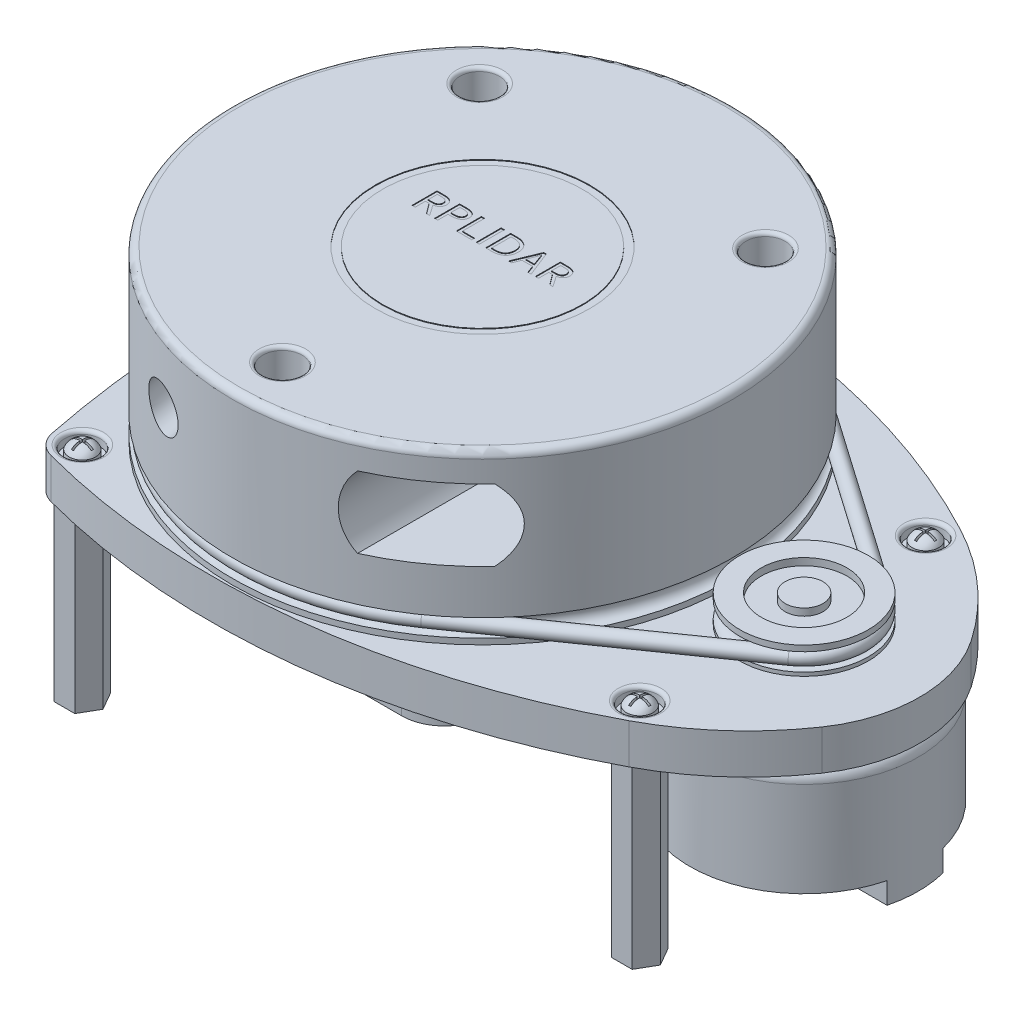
from build123d import *
from build123d.topology import SkipClean

# Parameters (mm, degrees)
SKETCH1_R                   = 35
PUCK_DEPTH                  = 23.5
FILLET1_R                   = 1
CUT_SENSOR_TUNNEL_DEPTH     = 55.792791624
BOSS_BOARD_START            = -0.5
BOSS_BOARD_DEPTH            = 5.6
HEX_STANDOFFS_DEPTH         = 25
SKETCH23_R                  = 2.5
SCREW_SEATS_DEPTH           = 1.5
FILLET_SCREW_SEATS_R        = 0.5
CUT_EXTRUDE5_START          = -0.5
CUT_EXTRUDE5_DEPTH          = 2
SKETCH6_R                   = 16
MOTOR_BODY_DEPTH            = 15
SKETCH9_R                   = 30
MOULD_BOTTOM_DISC_DEPTH     = 3.3
SKETCH10_W                  = 46
SKETCH10_H                  = 57
BOSS_CIRCUIT_DEPTH          = 1.1
FILLET_CIRCUIT_BOARD_R      = 6
SWEEP_BAND_PROFILE_R        = 1
FILLET3_R                   = 1.75
SKETCH18_R                  = 2.75
TOP_PUCK_HOLES_DEPTH        = 8
FILLET_PUCK_HOLES_R         = 0.5
SKETCH19_R                  = 15
SKETCH19_R_2                = 13.98
TOP_RING_AESTHETIC_DEPTH    = 0.1
SKETCH28_W                  = 0.443661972
SKETCH28_H                  = 3.5
RPLIDAR_TEXT_DEPTH          = 0.1
MOTOR_PLASTIC_FEATURE_DEPTH = 3
SKETCH31_R                  = 3.5
CUT_OPTICS_DEPTH            = 78.034465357
CUT_OPTICS_TAPER            = 1
SKETCH37_R                  = 1.25
DRILL_STANDOFFS_DEPTH       = 10


with BuildPart() as part:
    # Sketch1 → puck (new body)
    with BuildSketch(Plane(origin=(0, 0, 0), x_dir=(1, 0, 0), z_dir=(0, 1, 0))):
        with Locations(Location((0, 0, 0), (0, 0, 270))):
            Circle(SKETCH1_R)
    extrude(amount=PUCK_DEPTH)

    # Fillet1
    fillet1_edges = [part.edges().sort_by_distance(p)[0] for p in [
        (0, 23.5, -35),
    ]]
    fillet(fillet1_edges, radius=FILLET1_R)

    # Sketch2 → groove (revolve, cut)
    with BuildSketch(Plane.XY, mode=Mode.PRIVATE) as groove_sk:
        with BuildLine():
            Line((-35, 3.3), (-35, 0.8))
            ThreePointArc((-35, 0.8), (-33.75, 2.05), (-35, 3.3))
        make_face()
    revolve(groove_sk.sketch.rotate(Axis((0, 0, 0), (0, 1, 0)), 270), axis=Axis((0, 0, 0), (0, 1, 0)), mode=Mode.SUBTRACT)

    # Sketch3 → cut_sensor_tunnel (cut, through all)
    with BuildSketch(Plane.XY):
        with BuildLine():
            Line((14.409830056, 19.5), (25.590169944, 19.5))
            ThreePointArc((25.590169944, 19.5), (27.5, 14.5), (25.590169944, 9.5))
            Line((25.590169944, 9.5), (14.409830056, 9.5))
            ThreePointArc((14.409830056, 9.5), (12.5, 14.5), (14.409830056, 19.5))
        make_face()
    extrude(amount=CUT_SENSOR_TUNNEL_DEPTH, mode=Mode.SUBTRACT)



with BuildPart() as body_2:
    # Sketch4 → boss_board (new body)
    with BuildSketch(Plane(origin=(0, 0, 0), x_dir=(1, 0, 0), z_dir=(0, 1, 0)).offset(BOSS_BOARD_START)):
        with BuildLine():
            ThreePointArc((-28.9265577, 31.478719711), (8.165815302, 34.200883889), (43.687550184, 23.179964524))
            ThreePointArc((43.687550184, 23.179964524), (51.581142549, 17.68138932), (57.933651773, 10.457210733))
            ThreePointArc((57.933651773, 10.457210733), (61.172696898, 0), (57.933651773, -10.457210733))
            ThreePointArc((57.933651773, -10.457210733), (51.581142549, -17.68138932), (43.687550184, -23.179964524))
            ThreePointArc((43.687550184, -23.179964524), (8.165815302, -34.200883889), (-28.9265577, -31.478719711))
            ThreePointArc((-28.9265577, -31.478719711), (-30.621991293, -30.466812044), (-31.528712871, -28.712871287))
            ThreePointArc((-31.528712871, -28.712871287), (-34.4, 0), (-31.528712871, 28.712871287))
            ThreePointArc((-31.528712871, 28.712871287), (-30.621991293, 30.466812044), (-28.9265577, 31.478719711))
        make_face()
    extrude(amount=-BOSS_BOARD_DEPTH)

    # Sketch5 → hex_standoffs (add)
    with BuildSketch(Plane.XZ.offset(6.1)):
        Polygon((-26.556624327, 30.5), (-29.443375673, 30.5), (-30.886751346, 28), (-29.443375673, 25.5), (-26.556624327, 25.5), (-25.113248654, 28), align=None)
        Polygon((-26.556624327, -25.5), (-29.443375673, -25.5), (-30.886751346, -28), (-29.443375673, -30.5), (-26.556624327, -30.5), (-25.113248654, -28), align=None)
        Polygon((43.443375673, 22.5), (40.556624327, 22.5), (39.113248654, 20), (40.556624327, 17.5), (43.443375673, 17.5), (44.886751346, 20), align=None)
        Polygon((43.443375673, -17.5), (40.556624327, -17.5), (39.113248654, -20), (40.556624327, -22.5), (43.443375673, -22.5), (44.886751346, -20), align=None)
    extrude(amount=HEX_STANDOFFS_DEPTH)

    # Sketch23 → screw_seats (cut)
    with BuildSketch(Plane(origin=(0, -0.5, 0), x_dir=(1, 0, 0), z_dir=(0, 1, 0))):
        with Locations(Location((-28, 28, 0), (0, 0, 270))):
            Circle(SKETCH23_R)
        with Locations(Location((42, 20, 0), (0, 0, 270))):
            Circle(SKETCH23_R)
        with Locations(Location((42, -20, 0), (0, 0, 270))):
            Circle(SKETCH23_R)
        with Locations(Location((-28, -28, 0), (0, 0, 270))):
            Circle(SKETCH23_R)
    extrude(amount=-SCREW_SEATS_DEPTH, mode=Mode.SUBTRACT)

    # fillet_screw_seats
    fillet_screw_seats_edges = [body_2.edges().sort_by_distance(p)[0] for p in [
        (42, -0.5, 17.5),
        (-28, -0.5, 25.5),
        (-28, -0.5, -30.5),
        (42, -0.5, -22.5),
    ]]
    fillet(fillet_screw_seats_edges, radius=FILLET_SCREW_SEATS_R)

    # Sketch24 → revolve_screw_head (revolve)
    with BuildSketch(Plane.YZ.offset(-28), mode=Mode.PRIVATE) as revolve_screw_head_sk:
        with BuildLine():
            Line((-2, -28), (-2, -26.15))
            Line((-2, -26.15), (-1.041127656, -26.15))
            ThreePointArc((-1.041127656, -26.15), (-0.28319623, -26.795543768), (0, -27.75))
            Line((0, -27.75), (-1, -27.75))
            Line((-1, -27.75), (-1, -28))
            Line((-1, -28), (-2, -28))
        make_face()
    revolve_screw_head = revolve(revolve_screw_head_sk.sketch.rotate(Axis((-28, -2, -28), (0, 1, 0)), 180), axis=Axis((-28, -2, -28), (0, 1, 0)))

    # Sketch25 → Cut-Extrude5 (cut)
    with BuildSketch(Plane(origin=(0, -0.5, 0), x_dir=(1, 0, 0), z_dir=(0, 1, 0)).offset(CUT_EXTRUDE5_START)):
        Polygon((-27.85, 28.15), (-26.6, 28.15), (-26.6, 27.85), (-27.85, 27.85), (-27.85, 26.6), (-28.15, 26.6), (-28.15, 27.85), (-29.4, 27.85), (-29.4, 28.15), (-28.15, 28.15), (-28.15, 29.4), (-27.85, 29.4), align=None)
    cut_extrude5 = extrude(amount=CUT_EXTRUDE5_DEPTH, mode=Mode.SUBTRACT)

    # Sketch-Pattern1: revolve_screw_head, Cut-Extrude5 at 3 more places
    with Locations((70, 0, 8), (70, 0, 48), (0, 0, 56)):
        add(revolve_screw_head)
        add(cut_extrude5, mode=Mode.SUBTRACT)

    # Sketch9 → mould_bottom_disc (add)
    with BuildSketch(Plane.XZ.offset(6.1)):
        with Locations(Location((0, 0, 0), (0, 0, 90))):
            Circle(SKETCH9_R)
    extrude(amount=MOULD_BOTTOM_DISC_DEPTH)

    # Sketch10 → boss_circuit (add)
    with BuildSketch(Plane.XZ.offset(9.4)):
        with Locations((0.172696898, 0)):
            Rectangle(SKETCH10_W, SKETCH10_H)
    extrude(amount=BOSS_CIRCUIT_DEPTH)

    # fillet_circuit_board
    fillet_circuit_board_edges = [body_2.edges().sort_by_distance(p)[0] for p in [
        (-22.827303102, -9.95, 28.5),
        (-22.827303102, -9.95, -28.5),
        (23.172696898, -9.95, -28.5),
        (23.172696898, -9.95, 28.5),
    ]]
    fillet(fillet_circuit_board_edges, radius=FILLET_CIRCUIT_BOARD_R)


with BuildPart() as body_3:
    # Sketch6 → motor_body (new body)
    with BuildSketch(Plane.XZ.offset(6.1)):
        with Locations(Location((45, 0, 0), (0, 0, 270))):
            Circle(SKETCH6_R)
    extrude(amount=MOTOR_BODY_DEPTH)

    # Fillet3
    fillet3_edges = [body_3.edges().sort_by_distance(p)[0] for p in [
        (45, -6.1, 16),
    ]]
    fillet(fillet3_edges, radius=FILLET3_R)


    with SkipClean():  # the faces are left unmerged after this step: merging them gives an invalid solid
        add(body_2.part)  # motor_plastic_feature merges body 2
        # Sketch30 → motor_plastic_feature (add)
        with BuildSketch(Plane.XZ.offset(21.1)):
            with BuildLine():
                Line((29.482590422, 3.9), (60.517409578, 3.9))
                ThreePointArc((60.517409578, 3.9), (61, 0), (60.517409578, -3.9))
                Line((60.517409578, -3.9), (29.482590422, -3.9))
                ThreePointArc((29.482590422, -3.9), (29, 0), (29.482590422, 3.9))
            make_face()
        extrude(amount=MOTOR_PLASTIC_FEATURE_DEPTH)

    # Sketch37 → drill_standoffs (cut)
    with SkipClean():  # the faces are left unmerged after this step: merging them gives an invalid solid
        with BuildSketch(Plane.XZ.offset(31.1)):
            with Locations(Location((-28, 28, 0), (0, 0, 270))):
                Circle(SKETCH37_R)
            with Locations(Location((42, 20, 0), (0, 0, 270))):
                Circle(SKETCH37_R)
            with Locations(Location((-28, -28, 0), (0, 0, 270))):
                Circle(SKETCH37_R)
            with Locations(Location((42, -20, 0), (0, 0, 270))):
                Circle(SKETCH37_R)
        extrude(amount=-DRILL_STANDOFFS_DEPTH, mode=Mode.SUBTRACT)


with BuildPart() as body_4:
    # Sketch8 → motor_pulley (revolve)
    with BuildSketch(Plane.XY, mode=Mode.PRIVATE) as motor_pulley_sk:
        with BuildLine():
            Line((45, 4.1), (47.65, 4.1))
            Line((47.65, 4.1), (47.65, 3.1))
            Line((47.65, 3.1), (51, 3.1))
            Line((51, 3.1), (51, 4.1))
            Line((51, 4.1), (54, 4.1))
            Line((54, 4.1), (54, 3.283896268))
            ThreePointArc((54, 3.283896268), (52.55, 2.05), (54, 0.816103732))
            Line((54, 0.816103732), (54, 0.3))
            Line((54, 0.3), (47, 0.3))
            Line((47, 0.3), (47, 0))
            Line((47, 0), (45, 0))
            Line((45, 0), (45, 4.1))
        make_face()
    revolve(motor_pulley_sk.sketch.rotate(Axis((45, 0, 0), (0, 1, 0)), 90), axis=Axis((45, 0, 0), (0, 1, 0)))


with BuildPart() as part_1:
    add(part.part)

    add(body_4.part)  # sweep_band merges body 4
    # sweep_band: sweep along a path in Sketch12
    with BuildLine(Plane(origin=(0, 2.05, 0), x_dir=(1, 0, 0), z_dir=(0, 1, 0))) as sweep_band_path:
        Line((19.3125, 27.678328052), (49.577777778, 6.560788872))
        ThreePointArc((49.577777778, 6.560788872), (53, 0), (49.577777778, -6.560788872))
        Line((49.577777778, -6.560788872), (19.3125, -27.678328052))
        ThreePointArc((19.3125, -27.678328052), (-33.75, 0), (19.3125, 27.678328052))
    # sweep_band profile (on start of the path) → sweep_band (sweep)
    with BuildSketch(Plane(origin=(19.3125, 2.05, -27.678328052), x_dir=(-0.5722222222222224, 0, 0.8200986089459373), z_dir=(0.8200986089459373, 0, 0.5722222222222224))):
        Circle(SWEEP_BAND_PROFILE_R)
    sweep(path=sweep_band_path.line)

    # Sketch18 → top_puck_holes (cut)
    with BuildSketch(Plane(origin=(0, 23.5, 0), x_dir=(1, 0, 0), z_dir=(0, 1, 0))):
        with Locations(Location((-20, 19.595917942, 0), (0, 0, 270))):
            Circle(SKETCH18_R)
        with Locations(Location((20, 19.595917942, 0), (0, 0, 270))):
            Circle(SKETCH18_R)
        with Locations(Location((0, -28, 0), (0, 0, 270))):
            Circle(SKETCH18_R)
    extrude(amount=-TOP_PUCK_HOLES_DEPTH, mode=Mode.SUBTRACT)

    # fillet_puck_holes
    fillet_puck_holes_edges = [part_1.edges().sort_by_distance(p)[0] for p in [
        (-20, 23.5, -22.345917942),
        (20, 23.5, -22.345917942),
        (0, 23.5, 25.25),
    ]]
    fillet(fillet_puck_holes_edges, radius=FILLET_PUCK_HOLES_R)

    # Sketch19 → top_ring_aesthetic (cut)
    with BuildSketch(Plane(origin=(0, 23.5, 0), x_dir=(1, 0, 0), z_dir=(0, 1, 0))):
        with Locations(Location((0, 0, 0), (0, 0, 270))):
            Circle(SKETCH19_R)
        with Locations(Location((0, 0, 0), (0, 0, 270))):
            Circle(SKETCH19_R_2, mode=Mode.SUBTRACT)
    extrude(amount=-TOP_RING_AESTHETIC_DEPTH, mode=Mode.SUBTRACT)

    # Sketch28 → RPLIDAR_text (cut)
    # profile 1 of 7: a face of its own
    with BuildSketch(Plane(origin=(0, 23.5, 0), x_dir=(1, 0, 0), z_dir=(0, 1, 0))):
        with BuildLine():
            Line((-9.518699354, 1.527961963), (-9.518699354, 0.098384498))
            Line((-9.518699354, 0.098384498), (-9.962361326, 0.098384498))
            Line((-9.962361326, 0.098384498), (-9.962361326, 3.598384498))
            Line((-9.962361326, 3.598384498), (-9.047308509, 3.598384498))
            add(Edge.make_bspline(
                [(-9.047308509, 3.598384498), (-9.010074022, 3.598406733), (-8.938406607, 3.59844953), (-8.835454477, 3.594052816), (-8.741143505, 3.589187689), (-8.629287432, 3.578782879), (-8.500608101, 3.562788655), (-8.402690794, 3.538449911), (-8.355627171, 3.526751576)],
                knots=[0, 0, 0, 0, 0.960912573, 1.849525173, 2.659327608, 3.397884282, 4.749301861, 6, 6, 6, 6], degree=3))
            add(Edge.make_bspline(
                [(-8.355627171, 3.526751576), (-8.32571201, 3.518179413), (-8.267044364, 3.501368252), (-8.182896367, 3.46957633), (-8.103929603, 3.433197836), (-8.030296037, 3.392915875), (-7.962477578, 3.347539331), (-7.899900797, 3.298359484), (-7.842624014, 3.244247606), (-7.791107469, 3.185503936), (-7.744719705, 3.123478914), (-7.705062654, 3.05699123), (-7.671385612, 2.987122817), (-7.643138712, 2.913593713), (-7.622839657, 2.835966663), (-7.607231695, 2.754961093), (-7.597863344, 2.669943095), (-7.596737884, 2.61197871), (-7.596164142, 2.582429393)],
                knots=[0, 0, 0, 0, 1.134140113, 2.224201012, 3.275431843, 4.3018668, 5.280587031, 6.24687456, 7.200337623, 8.148687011, 9.092220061, 10.020068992, 10.966198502, 11.917131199, 12.886677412, 13.887177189, 14.922916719, 16, 16, 16, 16], degree=3))
            add(Edge.make_bspline(
                [(-7.596164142, 2.582429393), (-7.596708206, 2.547714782), (-7.597772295, 2.479819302), (-7.611806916, 2.380968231), (-7.631595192, 2.287193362), (-7.66253987, 2.199922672), (-7.699103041, 2.117905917), (-7.743742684, 2.041835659), (-7.794233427, 1.970683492), (-7.852662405, 1.905951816), (-7.916519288, 1.846214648), (-7.98752068, 1.793148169), (-8.063581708, 1.744207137), (-8.146449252, 1.702193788), (-8.234058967, 1.665367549), (-8.326527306, 1.633842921), (-8.423283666, 1.606327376), (-8.490301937, 1.593685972), (-8.52431115, 1.587270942)],
                knots=[0, 0, 0, 0, 1.112196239, 2.175254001, 3.195927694, 4.180088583, 5.138074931, 6.0714415, 7.003609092, 7.93070943, 8.862804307, 9.803008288, 10.769096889, 11.759573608, 12.777920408, 13.814147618, 14.890763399, 16, 16, 16, 16], degree=3))
            Line((-8.52431115, 1.587270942), (-8.52431115, 1.577257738))
            Line((-8.52431115, 1.577257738), (-7.497572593, 0.098384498))
            Line((-7.497572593, 0.098384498), (-7.941234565, 0.098384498))
            Line((-7.941234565, 0.098384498), (-9.008796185, 1.527961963))
            Line((-9.008796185, 1.527961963), (-9.518699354, 1.527961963))
        make_face()
        with BuildLine():
            Line((-9.518699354, 3.204018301), (-9.518699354, 1.92232816))
            Line((-9.518699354, 1.92232816), (-9.108157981, 1.92232816))
            add(Edge.make_bspline(
                [(-9.108157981, 1.92232816), (-9.077604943, 1.922498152), (-9.018543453, 1.92282676), (-8.933504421, 1.924700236), (-8.855482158, 1.929845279), (-8.762988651, 1.936185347), (-8.657718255, 1.950503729), (-8.57830983, 1.972114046), (-8.540486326, 1.982407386)],
                knots=[0, 0, 0, 0, 0.960008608, 1.855774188, 2.671979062, 3.416289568, 4.769337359, 6, 6, 6, 6], degree=3))
            add(Edge.make_bspline(
                [(-8.540486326, 1.982407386), (-8.505942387, 1.994557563), (-8.439057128, 2.01808319), (-8.34806215, 2.067850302), (-8.269714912, 2.127792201), (-8.203968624, 2.197998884), (-8.150750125, 2.279302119), (-8.115648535, 2.373286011), (-8.092041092, 2.477539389), (-8.090124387, 2.550960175), (-8.089121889, 2.589361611)],
                knots=[0, 0, 0, 0, 1.071897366, 2.075447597, 3.025191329, 3.951603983, 4.882559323, 5.852363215, 6.876716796, 8, 8, 8, 8], degree=3))
            add(Edge.make_bspline(
                [(-8.089121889, 2.589361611), (-8.090561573, 2.625176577), (-8.093324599, 2.693912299), (-8.115315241, 2.791166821), (-8.149790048, 2.877951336), (-8.199465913, 2.952805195), (-8.260469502, 3.017205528), (-8.331379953, 3.07260791), (-8.413259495, 3.117993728), (-8.473353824, 3.138682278), (-8.504284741, 3.149330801)],
                knots=[0, 0, 0, 0, 1.140384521, 2.188614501, 3.161159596, 4.10078681, 5.032829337, 5.977325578, 6.958917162, 8, 8, 8, 8], degree=3))
            add(Edge.make_bspline(
                [(-8.504284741, 3.149330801), (-8.53777504, 3.158218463), (-8.609899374, 3.177358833), (-8.706556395, 3.190130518), (-8.794367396, 3.196598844), (-8.870856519, 3.201671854), (-8.956153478, 3.203533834), (-9.015985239, 3.203851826), (-9.047308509, 3.204018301)],
                knots=[0, 0, 0, 0, 1.138118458, 2.451039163, 3.196085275, 4.033155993, 4.970312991, 6, 6, 6, 6], degree=3))
            Line((-9.047308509, 3.204018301), (-9.518699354, 3.204018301))
        make_face(mode=Mode.SUBTRACT)
    # profile 2 of 7: a face of its own
    with BuildSketch(Plane(origin=(0, 23.5, 0), x_dir=(1, 0, 0), z_dir=(0, 1, 0))):
        with BuildLine():
            Line((-6.363769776, 0.098384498), (-6.807431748, 0.098384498))
            Line((-6.807431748, 0.098384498), (-6.807431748, 3.598384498))
            Line((-6.807431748, 3.598384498), (-5.829988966, 3.598384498))
            add(Edge.make_bspline(
                [(-5.829988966, 3.598384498), (-5.759832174, 3.597462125), (-5.624599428, 3.595684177), (-5.430047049, 3.574869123), (-5.250224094, 3.543768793), (-5.138517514, 3.508439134), (-5.084390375, 3.491320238)],
                knots=[0, 0, 0, 0, 1.112150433, 2.14375761, 3.100562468, 4, 4, 4, 4], degree=3))
            add(Edge.make_bspline(
                [(-5.084390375, 3.491320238), (-5.058575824, 3.481646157), (-5.008119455, 3.462737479), (-4.936236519, 3.429197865), (-4.868812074, 3.393156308), (-4.80617398, 3.353036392), (-4.748500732, 3.308942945), (-4.694848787, 3.262176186), (-4.647159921, 3.210908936), (-4.603868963, 3.156866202), (-4.564937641, 3.099736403), (-4.53185605, 3.03875291), (-4.504449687, 2.974603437), (-4.48055705, 2.907686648), (-4.46358854, 2.837088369), (-4.45015261, 2.763600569), (-4.4423331, 2.686840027), (-4.441606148, 2.634566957), (-4.441234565, 2.607847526)],
                knots=[0, 0, 0, 0, 1.124580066, 2.198071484, 3.23409666, 4.24257832, 5.229550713, 6.194477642, 7.143228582, 8.082444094, 9.018146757, 9.960512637, 10.908395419, 11.862683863, 12.856251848, 13.867396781, 14.909917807, 16, 16, 16, 16], degree=3))
            add(Edge.make_bspline(
                [(-4.441234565, 2.607847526), (-4.442649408, 2.564650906), (-4.445401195, 2.480635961), (-4.464378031, 2.358270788), (-4.498690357, 2.244629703), (-4.545185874, 2.138767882), (-4.604016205, 2.041024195), (-4.67551126, 1.951665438), (-4.759678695, 1.871343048), (-4.854903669, 1.798636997), (-4.961595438, 1.734555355), (-5.079897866, 1.680479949), (-5.20795629, 1.631990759), (-5.347675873, 1.594320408), (-5.4971941, 1.564446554), (-5.656408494, 1.542846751), (-5.825182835, 1.530892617), (-5.940886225, 1.528955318), (-6.000213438, 1.527961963)],
                knots=[0, 0, 0, 0, 0.968750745, 1.884164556, 2.767711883, 3.623640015, 4.470924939, 5.318933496, 6.182267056, 7.073659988, 8.000931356, 8.966940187, 9.987281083, 11.06853522, 12.207958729, 13.405037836, 14.669426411, 16, 16, 16, 16], degree=3))
            add(Edge.make_bspline(
                [(-6.000213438, 1.527961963), (-6.059547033, 1.528658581), (-6.180888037, 1.530083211), (-6.301920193, 1.538874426), (-6.363769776, 1.543366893)],
                knots=[0, 0, 0, 0, 0.977964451, 2, 2, 2, 2], degree=3))
            Line((-6.363769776, 1.543366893), (-6.363769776, 0.098384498))
        make_face()
        with BuildLine():
            add(Edge.make_bspline(
                [(-6.363769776, 1.943124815), (-6.33502979, 1.939900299), (-6.276603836, 1.933345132), (-6.18826656, 1.926148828), (-6.100870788, 1.923763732), (-6.043346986, 1.922795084), (-6.015618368, 1.92232816)],
                knots=[0, 0, 0, 0, 0.994453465, 2.021639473, 3.046356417, 4, 4, 4, 4], degree=3))
            add(Edge.make_bspline(
                [(-6.015618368, 1.92232816), (-5.968621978, 1.922955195), (-5.878143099, 1.92416238), (-5.748006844, 1.932306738), (-5.628691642, 1.94694808), (-5.519862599, 1.96683273), (-5.420638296, 1.991552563), (-5.332023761, 2.023885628), (-5.251678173, 2.058306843), (-5.181712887, 2.100638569), (-5.120527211, 2.147473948), (-5.068242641, 2.199372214), (-5.025448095, 2.256316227), (-4.991075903, 2.317687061), (-4.965916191, 2.384060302), (-4.947195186, 2.45447369), (-4.93652378, 2.52947182), (-4.934980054, 2.580856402), (-4.934192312, 2.60707728)],
                knots=[0, 0, 0, 0, 1.553856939, 2.991532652, 4.308749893, 5.52587743, 6.647999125, 7.684421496, 8.642023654, 9.533004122, 10.380289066, 11.184640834, 11.960536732, 12.728168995, 13.50220512, 14.301118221, 15.133082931, 16, 16, 16, 16], degree=3))
            add(Edge.make_bspline(
                [(-4.934192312, 2.60707728), (-4.935344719, 2.638997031), (-4.937557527, 2.700288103), (-4.955224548, 2.787822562), (-4.985604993, 2.866175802), (-5.027704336, 2.935711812), (-5.08132944, 2.996667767), (-5.144745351, 3.049744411), (-5.218341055, 3.095433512), (-5.272720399, 3.117762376), (-5.300829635, 3.129304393)],
                knots=[0, 0, 0, 0, 1.117778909, 2.146315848, 3.111871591, 4.048326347, 4.979190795, 5.943236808, 6.93683817, 8, 8, 8, 8], degree=3))
            add(Edge.make_bspline(
                [(-5.300829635, 3.129304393), (-5.339832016, 3.142243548), (-5.421897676, 3.169469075), (-5.532315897, 3.185215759), (-5.628306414, 3.195441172), (-5.707971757, 3.200670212), (-5.793503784, 3.203788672), (-5.852579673, 3.203940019), (-5.883135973, 3.204018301)],
                knots=[0, 0, 0, 0, 1.251428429, 2.633154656, 3.389182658, 4.197833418, 5.067850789, 6, 6, 6, 6], degree=3))
            Line((-5.883135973, 3.204018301), (-6.363769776, 3.204018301))
            Line((-6.363769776, 3.204018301), (-6.363769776, 1.943124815))
        make_face(mode=Mode.SUBTRACT)
    # profile 3 of 7: a face of its own
    with BuildSketch(Plane(origin=(0, 23.5, 0), x_dir=(1, 0, 0), z_dir=(0, 1, 0))):
        Polygon((-3.307431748, 3.598384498), (-3.307431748, 0.492750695), (-1.609808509, 0.492750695), (-1.609808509, 0.098384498), (-3.75109372, 0.098384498), (-3.75109372, 3.598384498), align=None)
    # profile 4 of 7: a face of its own
    with BuildSketch(Plane(origin=(0, 23.5, 0), x_dir=(1, 0, 0), z_dir=(0, 1, 0))):
        with Locations((-0.768699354, 1.848384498)):
            Rectangle(SKETCH28_W, SKETCH28_H)
    # profile 5 of 7: a face of its own
    with BuildSketch(Plane(origin=(0, 23.5, 0), x_dir=(1, 0, 0), z_dir=(0, 1, 0))):
        with BuildLine():
            add(Edge.make_bspline(
                [(3.150314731, 1.863789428), (3.149443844, 1.81343591), (3.147729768, 1.714330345), (3.13364302, 1.567840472), (3.109742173, 1.426064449), (3.076696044, 1.288832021), (3.034765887, 1.157298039), (2.982646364, 1.032098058), (2.921286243, 0.913698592), (2.850119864, 0.801865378), (2.768680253, 0.698114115), (2.67935871, 0.599815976), (2.578432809, 0.511124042), (2.469872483, 0.428119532), (2.351486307, 0.353672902), (2.222768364, 0.289655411), (2.085550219, 0.231519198), (1.988833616, 0.202015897), (1.939487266, 0.186962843)],
                knots=[0, 0, 0, 0, 1.078960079, 2.123604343, 3.150299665, 4.15788564, 5.14625318, 6.105773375, 7.060644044, 8.000881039, 8.941922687, 9.884282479, 10.842950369, 11.816876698, 12.810727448, 13.834395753, 14.895074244, 16, 16, 16, 16], degree=3))
            add(Edge.make_bspline(
                [(1.939487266, 0.186962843), (1.879630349, 0.171991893), (1.755831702, 0.141028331), (1.559399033, 0.115028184), (1.347914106, 0.100701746), (1.201874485, 0.099176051), (1.126106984, 0.098384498)],
                knots=[0, 0, 0, 0, 0.901624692, 1.864778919, 2.892215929, 4, 4, 4, 4], degree=3))
            Line((1.126106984, 0.098384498), (0.340455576, 0.098384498))
            Line((0.340455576, 0.098384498), (0.340455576, 3.598384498))
            Line((0.340455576, 3.598384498), (1.133809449, 3.598384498))
            add(Edge.make_bspline(
                [(1.133809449, 3.598384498), (1.209587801, 3.597718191), (1.355666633, 3.596433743), (1.566989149, 3.580431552), (1.763605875, 3.556025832), (1.887344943, 3.524872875), (1.947189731, 3.509806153)],
                knots=[0, 0, 0, 0, 1.107853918, 2.135623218, 3.09831846, 4, 4, 4, 4], degree=3))
            add(Edge.make_bspline(
                [(1.947189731, 3.509806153), (1.996512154, 3.494691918), (2.093088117, 3.46509743), (2.230450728, 3.407918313), (2.359178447, 3.344668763), (2.477323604, 3.270921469), (2.585789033, 3.189732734), (2.686479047, 3.103116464), (2.77461477, 3.00664934), (2.854733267, 2.904742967), (2.924698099, 2.795709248), (2.986149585, 2.680564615), (3.036859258, 2.558132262), (3.078265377, 2.429524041), (3.110546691, 2.295347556), (3.133556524, 2.156096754), (3.14776804, 2.011716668), (3.149456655, 1.913631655), (3.150314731, 1.863789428)],
                knots=[0, 0, 0, 0, 1.119747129, 2.192525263, 3.227419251, 4.231648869, 5.211937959, 6.16820741, 7.111232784, 8.044847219, 8.980607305, 9.92100777, 10.875812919, 11.85449892, 12.852610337, 13.870158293, 14.917713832, 16, 16, 16, 16], degree=3))
        make_face()
        with BuildLine():
            add(Edge.make_bspline(
                [(2.706652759, 1.863789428), (2.70615446, 1.904635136), (2.705181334, 1.984402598), (2.694865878, 2.101199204), (2.678394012, 2.211946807), (2.654138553, 2.316590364), (2.624326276, 2.415620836), (2.5876464, 2.508851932), (2.543293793, 2.595879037), (2.492257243, 2.676897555), (2.435317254, 2.752411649), (2.372435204, 2.822241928), (2.303866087, 2.886476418), (2.228654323, 2.944100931), (2.148192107, 2.996864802), (2.061896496, 3.043719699), (1.969684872, 3.084940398), (1.905267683, 3.107193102), (1.872475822, 3.118520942)],
                knots=[0, 0, 0, 0, 1.203903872, 2.351100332, 3.453730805, 4.502185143, 5.515033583, 6.500355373, 7.451594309, 8.390343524, 9.319861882, 10.23637587, 11.157535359, 12.085634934, 13.0261829, 13.991531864, 14.977580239, 16, 16, 16, 16], degree=3))
            add(Edge.make_bspline(
                [(1.872475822, 3.118520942), (1.846098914, 3.12621812), (1.792155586, 3.141959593), (1.708415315, 3.161193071), (1.619896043, 3.175794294), (1.52675616, 3.185961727), (1.428432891, 3.194922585), (1.324344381, 3.199540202), (1.214210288, 3.204076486), (1.138693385, 3.204038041), (1.099918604, 3.204018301)],
                knots=[0, 0, 0, 0, 0.845083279, 1.728277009, 2.64102572, 3.603014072, 4.609768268, 5.677380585, 6.807431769, 8, 8, 8, 8], degree=3))
            Line((1.099918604, 3.204018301), (0.784117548, 3.204018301))
            Line((0.784117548, 3.204018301), (0.784117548, 0.492750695))
            Line((0.784117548, 0.492750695), (1.099918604, 0.492750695))
            add(Edge.make_bspline(
                [(1.099918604, 0.492750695), (1.138692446, 0.492741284), (1.214207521, 0.492722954), (1.32435454, 0.497117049), (1.428376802, 0.502229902), (1.526864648, 0.509483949), (1.619829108, 0.521296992), (1.708424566, 0.535493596), (1.792153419, 0.554828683), (1.846098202, 0.570557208), (1.872475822, 0.578248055)],
                knots=[0, 0, 0, 0, 1.192525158, 2.322535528, 3.390109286, 4.396176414, 5.359069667, 6.271785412, 7.154947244, 8, 8, 8, 8], degree=3))
            add(Edge.make_bspline(
                [(1.872475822, 0.578248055), (1.905295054, 0.589513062), (1.96986564, 0.611676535), (2.061890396, 0.653901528), (2.14840877, 0.701401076), (2.228959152, 0.75572101), (2.303595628, 0.815826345), (2.37303251, 0.88149798), (2.435028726, 0.954450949), (2.492527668, 1.032329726), (2.543515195, 1.116532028), (2.587280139, 1.20688291), (2.624381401, 1.302721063), (2.65412504, 1.404084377), (2.678305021, 1.510783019), (2.694876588, 1.623302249), (2.705176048, 1.741639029), (2.706152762, 1.822430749), (2.706652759, 1.863789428)],
                knots=[0, 0, 0, 0, 1.006667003, 1.98057894, 2.934641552, 3.868938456, 4.796583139, 5.713780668, 6.638546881, 7.571683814, 8.52134086, 9.491281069, 10.482238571, 11.500889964, 12.554993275, 13.655371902, 14.799744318, 16, 16, 16, 16], degree=3))
        make_face(mode=Mode.SUBTRACT)
    # profile 6 of 7: a face of its own
    with BuildSketch(Plane(origin=(0, 23.5, 0), x_dir=(1, 0, 0), z_dir=(0, 1, 0))):
        Polygon((3.533127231, 0.098384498), (4.974258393, 3.598384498), (5.319328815, 3.598384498), (6.716555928, 0.098384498), (6.255948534, 0.098384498), (5.876217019, 1.133595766), (4.385019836, 1.133595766), (3.9883429, 0.098384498), align=None)
        with BuildLine():
            add(Edge.make_bspline(
                [(5.122145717, 3.056130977), (5.081045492, 2.94907454), (5.000827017, 2.740124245), (4.883899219, 2.434535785), (4.772820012, 2.144373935), (4.700578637, 1.956213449), (4.665389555, 1.864559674)],
                knots=[0, 0, 0, 0, 1.078349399, 2.104697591, 3.07679012, 4, 4, 4, 4], degree=3))
            Line((4.665389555, 1.864559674), (4.535988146, 1.527961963))
            Line((4.535988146, 1.527961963), (5.732180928, 1.527961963))
            Line((5.732180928, 1.527961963), (5.607400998, 1.866100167))
            add(Edge.make_bspline(
                [(5.607400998, 1.866100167), (5.57359919, 1.959075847), (5.504466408, 2.149233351), (5.396738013, 2.440212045), (5.286646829, 2.744435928), (5.210332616, 2.950908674), (5.171441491, 3.056130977)],
                knots=[0, 0, 0, 0, 0.936701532, 1.915778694, 2.937842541, 4, 4, 4, 4], degree=3))
            Line((5.171441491, 3.056130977), (5.122145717, 3.056130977))
        make_face(mode=Mode.SUBTRACT)
    # profile 7 of 7: a face of its own
    with BuildSketch(Plane(origin=(0, 23.5, 0), x_dir=(1, 0, 0), z_dir=(0, 1, 0))):
        with BuildLine():
            Line((7.734821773, 1.527961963), (7.734821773, 0.098384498))
            Line((7.734821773, 0.098384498), (7.291159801, 0.098384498))
            Line((7.291159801, 0.098384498), (7.291159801, 3.598384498))
            Line((7.291159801, 3.598384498), (8.206212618, 3.598384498))
            add(Edge.make_bspline(
                [(8.206212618, 3.598384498), (8.243447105, 3.598406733), (8.31511452, 3.59844953), (8.418066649, 3.594052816), (8.512377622, 3.589187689), (8.624233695, 3.578782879), (8.752913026, 3.562788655), (8.850830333, 3.538449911), (8.897893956, 3.526751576)],
                knots=[0, 0, 0, 0, 0.960912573, 1.849525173, 2.659327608, 3.397884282, 4.749301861, 6, 6, 6, 6], degree=3))
            add(Edge.make_bspline(
                [(8.897893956, 3.526751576), (8.927809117, 3.518179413), (8.986476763, 3.501368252), (9.07062476, 3.46957633), (9.149591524, 3.433197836), (9.22322509, 3.392915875), (9.291043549, 3.347539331), (9.353620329, 3.298359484), (9.410897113, 3.244247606), (9.462413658, 3.185503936), (9.508801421, 3.123478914), (9.548458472, 3.05699123), (9.582135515, 2.987122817), (9.610382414, 2.913593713), (9.63068147, 2.835966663), (9.646289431, 2.754961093), (9.655657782, 2.669943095), (9.656783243, 2.61197871), (9.657356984, 2.582429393)],
                knots=[0, 0, 0, 0, 1.134140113, 2.224201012, 3.275431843, 4.3018668, 5.280587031, 6.24687456, 7.200337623, 8.148687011, 9.092220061, 10.020068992, 10.966198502, 11.917131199, 12.886677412, 13.887177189, 14.922916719, 16, 16, 16, 16], degree=3))
            add(Edge.make_bspline(
                [(9.657356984, 2.582429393), (9.656812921, 2.547714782), (9.655748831, 2.479819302), (9.641714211, 2.380968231), (9.621925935, 2.287193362), (9.590981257, 2.199922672), (9.554418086, 2.117905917), (9.509778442, 2.041835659), (9.459287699, 1.970683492), (9.400858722, 1.905951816), (9.337001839, 1.846214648), (9.266000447, 1.793148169), (9.189939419, 1.744207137), (9.107071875, 1.702193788), (9.01946216, 1.665367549), (8.92699382, 1.633842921), (8.830237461, 1.606327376), (8.76321919, 1.593685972), (8.729209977, 1.587270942)],
                knots=[0, 0, 0, 0, 1.112196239, 2.175254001, 3.195927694, 4.180088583, 5.138074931, 6.0714415, 7.003609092, 7.93070943, 8.862804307, 9.803008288, 10.769096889, 11.759573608, 12.777920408, 13.814147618, 14.890763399, 16, 16, 16, 16], degree=3))
            Line((8.729209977, 1.587270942), (8.729209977, 1.577257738))
            Line((8.729209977, 1.577257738), (9.755948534, 0.098384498))
            Line((9.755948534, 0.098384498), (9.312286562, 0.098384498))
            Line((9.312286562, 0.098384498), (8.244724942, 1.527961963))
            Line((8.244724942, 1.527961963), (7.734821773, 1.527961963))
        make_face()
        with BuildLine():
            Line((7.734821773, 3.204018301), (7.734821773, 1.92232816))
            Line((7.734821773, 1.92232816), (8.145363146, 1.92232816))
            add(Edge.make_bspline(
                [(8.145363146, 1.92232816), (8.175916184, 1.922498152), (8.234977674, 1.92282676), (8.320016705, 1.924700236), (8.398038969, 1.929845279), (8.490532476, 1.936185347), (8.595802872, 1.950503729), (8.675211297, 1.972114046), (8.713034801, 1.982407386)],
                knots=[0, 0, 0, 0, 0.960008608, 1.855774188, 2.671979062, 3.416289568, 4.769337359, 6, 6, 6, 6], degree=3))
            add(Edge.make_bspline(
                [(8.713034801, 1.982407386), (8.747578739, 1.994557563), (8.814463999, 2.01808319), (8.905458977, 2.067850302), (8.983806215, 2.127792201), (9.049552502, 2.197998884), (9.102771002, 2.279302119), (9.137872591, 2.373286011), (9.161480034, 2.477539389), (9.163396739, 2.550960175), (9.164399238, 2.589361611)],
                knots=[0, 0, 0, 0, 1.071897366, 2.075447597, 3.025191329, 3.951603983, 4.882559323, 5.852363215, 6.876716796, 8, 8, 8, 8], degree=3))
            add(Edge.make_bspline(
                [(9.164399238, 2.589361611), (9.162959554, 2.625176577), (9.160196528, 2.693912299), (9.138205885, 2.791166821), (9.103731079, 2.877951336), (9.054055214, 2.952805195), (8.993051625, 3.017205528), (8.922141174, 3.07260791), (8.840261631, 3.117993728), (8.780167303, 3.138682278), (8.749236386, 3.149330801)],
                knots=[0, 0, 0, 0, 1.140384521, 2.188614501, 3.161159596, 4.10078681, 5.032829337, 5.977325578, 6.958917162, 8, 8, 8, 8], degree=3))
            add(Edge.make_bspline(
                [(8.749236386, 3.149330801), (8.715746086, 3.158218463), (8.643621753, 3.177358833), (8.546964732, 3.190130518), (8.459153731, 3.196598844), (8.382664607, 3.201671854), (8.297367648, 3.203533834), (8.237535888, 3.203851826), (8.206212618, 3.204018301)],
                knots=[0, 0, 0, 0, 1.138118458, 2.451039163, 3.196085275, 4.033155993, 4.970312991, 6, 6, 6, 6], degree=3))
            Line((8.206212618, 3.204018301), (7.734821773, 3.204018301))
        make_face(mode=Mode.SUBTRACT)
    extrude(amount=-RPLIDAR_TEXT_DEPTH, mode=Mode.SUBTRACT)

    # Sketch31 → cut_optics (cut, through all)
    with BuildSketch(Plane(origin=(0, 0, 0), x_dir=(0, -1, 0), z_dir=(0.17364817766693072, 0, 0.984807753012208))):
        with Locations((-14.5, -17.390175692)):
            Circle(SKETCH31_R)
    extrude(amount=CUT_OPTICS_DEPTH, taper=CUT_OPTICS_TAPER, mode=Mode.SUBTRACT)


solid = Compound([body_3.part, part_1.part])
